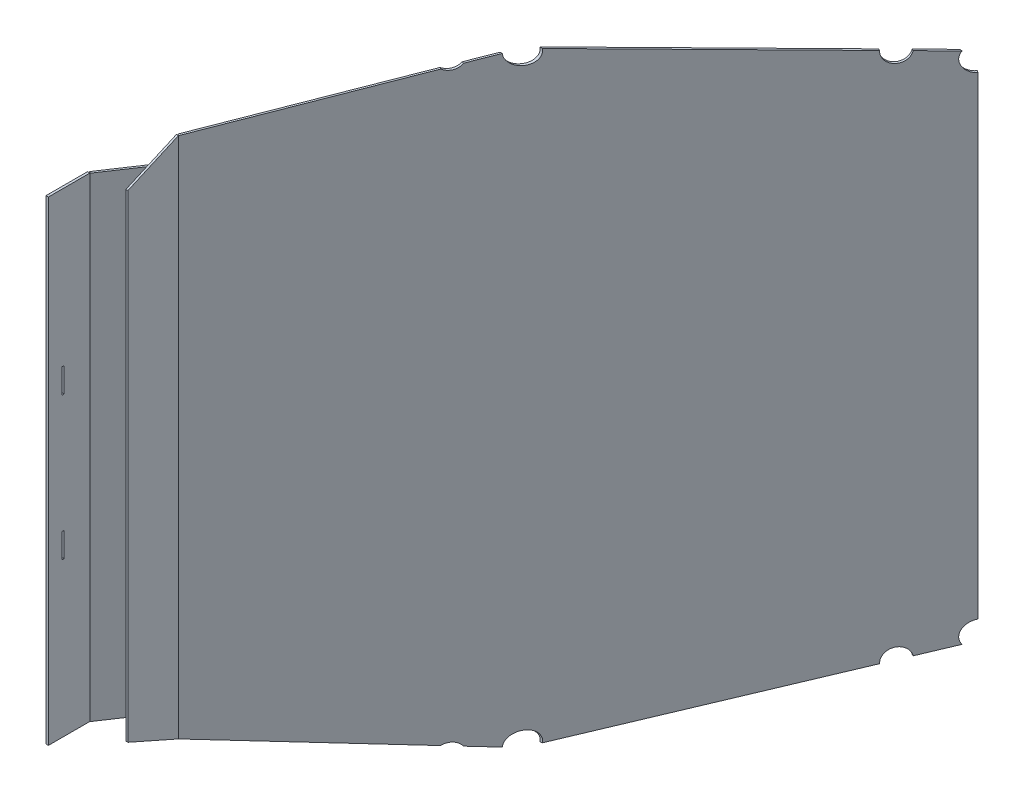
from build123d import *

# Parameters (mm, degrees)
BOSS_EXTRUDE1_DEPTH = 2.159
BOSS_EXTRUDE2_DEPTH = 2.159
SKETCH5_R           = 12.954
CUT_EXTRUDE1_DEPTH  = 621.665
SKETCH6_R           = 12.954
CUT_EXTRUDE2_DEPTH  = 1057.425179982
SKETCH7_R           = 12.954
CUT_EXTRUDE3_DEPTH  = 1057.425179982
SKETCH8_R           = 12.954
CUT_EXTRUDE4_DEPTH  = 1172.774112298
SKETCH10_W          = 44.45
SKETCH10_H          = 508
SKETCH10_W_2        = 2.546199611
SKETCH10_H_2        = 26.284614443
BOSS_EXTRUDE3_DEPTH = 2.54


with BuildPart() as part:
    # Sketch3 → Boss-Extrude1 (new body)
    with BuildSketch(Plane(origin=(251.476706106, 0, 168.307390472), x_dir=(-0.5562007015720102, 0, 0.8310480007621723), z_dir=(-0.8310480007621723, 0, -0.5562007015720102))):
        Polygon((-187.204535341, -273.05), (-187.204535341, 273.05), (164.402521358, 323.85), (429.299541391, 279.4), (429.299541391, 254), (497.262516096, 254), (497.262516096, -254), (429.299541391, -254), (429.299541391, -279.4), (164.402521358, -323.85), align=None)
    extrude(amount=BOSS_EXTRUDE1_DEPTH)

    # Sketch5 → Cut-Extrude1 (cut)
    with BuildSketch(Plane(origin=(825.5, 177.8, 47.625), x_dir=(-0.07152915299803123, 0.013455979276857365, 0.9973477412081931), z_dir=(-0.9801553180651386, 0.18438565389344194, -0.07278381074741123))):
        Circle(SKETCH5_R)
    cut_extrude1 = extrude(amount=CUT_EXTRUDE1_DEPTH, mode=Mode.SUBTRACT)

    # Sketch6 → Cut-Extrude2 (cut, through all)
    with BuildSketch(Plane(origin=(825.5, 227.0125, 304.8), x_dir=(-0.42445842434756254, 0.047278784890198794, 0.9042122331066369), z_dir=(-0.8986546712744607, 0.1000976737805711, -0.4270834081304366))):
        Circle(SKETCH6_R)
    cut_extrude2 = extrude(amount=CUT_EXTRUDE2_DEPTH, mode=Mode.SUBTRACT)

    # Sketch7 → Cut-Extrude3 (cut, through all)
    with BuildSketch(Plane(origin=(825.5, 227.0125, 304.8), x_dir=(-0.00023887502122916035, 3.372792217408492e-05, 0.9999999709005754), z_dir=(-0.9901785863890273, 0.13980811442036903, -0.00024124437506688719))):
        Circle(SKETCH7_R)
    cut_extrude3 = extrude(amount=CUT_EXTRUDE3_DEPTH, mode=Mode.SUBTRACT)

    # Sketch8 → Cut-Extrude4 (cut, through all)
    with BuildSketch(Plane(origin=(825.5, 220.292352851, 603.464669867), x_dir=(-0.3334143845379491, 0.04979061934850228, 0.9414646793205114), z_dir=(-0.9311392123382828, 0.13905218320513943, -0.33711163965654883))):
        Circle(SKETCH8_R)
    cut_extrude4 = extrude(amount=CUT_EXTRUDE4_DEPTH, mode=Mode.SUBTRACT)

    # Mirror1: Cut-Extrude1, Cut-Extrude2, Cut-Extrude3, Cut-Extrude4 across plane
    add(cut_extrude1.mirror(Plane.ZX), mode=Mode.SUBTRACT)
    add(cut_extrude2.mirror(Plane.ZX), mode=Mode.SUBTRACT)
    add(cut_extrude3.mirror(Plane.ZX), mode=Mode.SUBTRACT)
    add(cut_extrude4.mirror(Plane.ZX), mode=Mode.SUBTRACT)


with BuildPart() as body_2:
    # Sketch4 → Boss-Extrude2 (new body)
    with BuildSketch(Plane.ZY.offset(-12.7)):
        Polygon((525.075916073, -279.4), (525.075916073, 279.4), (579.050916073, 255.529861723), (579.050916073, -255.529861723), align=None)
    extrude(amount=BOSS_EXTRUDE2_DEPTH)


with BuildPart() as body_3:
    # Sketch10 → Boss-Extrude3 (new body)
    with BuildSketch(Plane(origin=(-25.4, 0, 0), x_dir=(0, 0, -1), z_dir=(1, 0, 0))):
        with Locations((-603.781410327, 0)):
            Rectangle(SKETCH10_W, SKETCH10_H)
        with Locations((-610.405741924, 76.257111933)):
            Rectangle(SKETCH10_W_2, SKETCH10_H_2, mode=Mode.SUBTRACT)
        with Locations((-610.405741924, -76.257111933)):
            Rectangle(SKETCH10_W_2, SKETCH10_H_2, mode=Mode.SUBTRACT)
    extrude(amount=-BOSS_EXTRUDE3_DEPTH)


solid = Compound([part.part, body_2.part, body_3.part])
